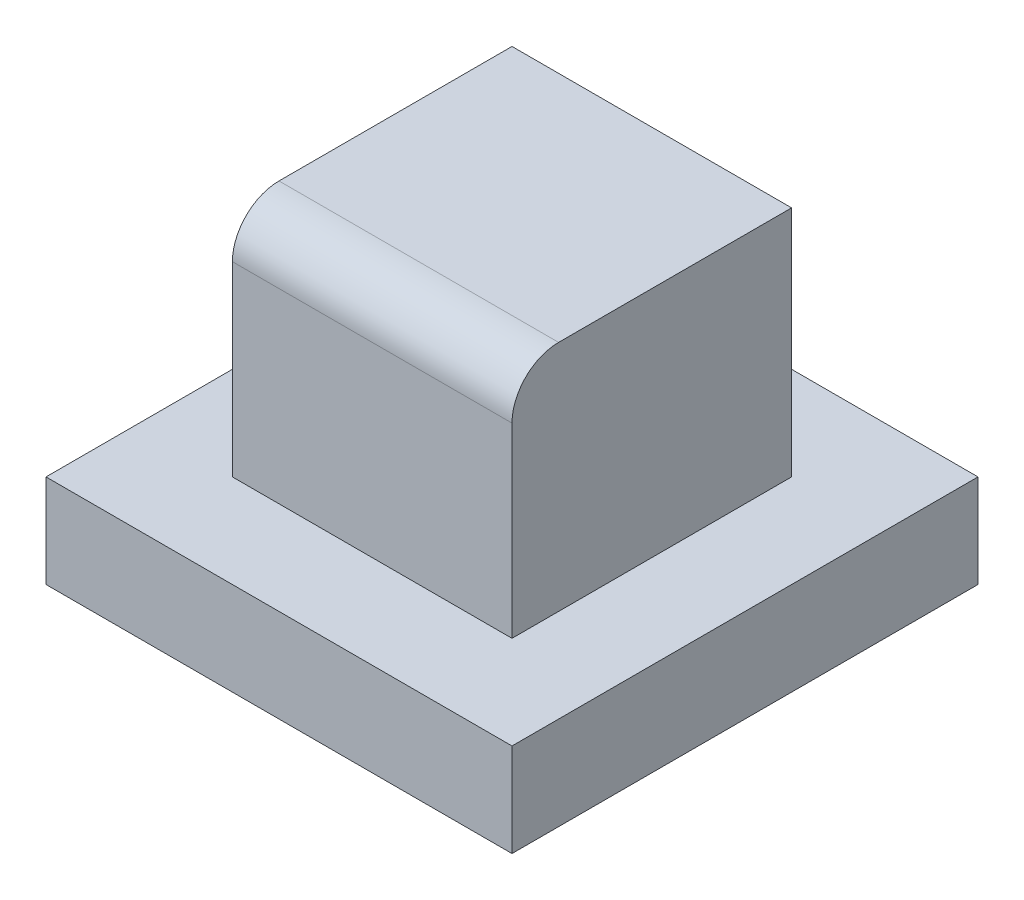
from build123d import *

# Parameters (mm, degrees)
SKETCH1_W      = 100
SKETCH1_H      = 20
EXTRUDE1_DEPTH = 50
SKETCH2_W      = 60
SKETCH2_H      = 60
EXTRUDE2_DEPTH = 50
FILLET1_R      = 10


with BuildPart() as part:
    # Sketch1 → Extrude1 (new, symmetric)
    with BuildSketch(Plane.XY):
        with Locations((0, 10)):
            Rectangle(SKETCH1_W, SKETCH1_H)
    extrude(amount=EXTRUDE1_DEPTH, both=True)

    # Sketch2 → Extrude2 (add)
    with BuildSketch(Plane(origin=(0, 20, 0), x_dir=(-1, 0, 0), z_dir=(0, 1, 0))):
        Rectangle(SKETCH2_W, SKETCH2_H)
    extrude(amount=EXTRUDE2_DEPTH)

    # Fillet1
    fillet1_edges = [part.edges().sort_by_distance(p)[0] for p in [
        (0, 70, 30),
    ]]
    fillet(fillet1_edges, radius=FILLET1_R)


solid = part.part
